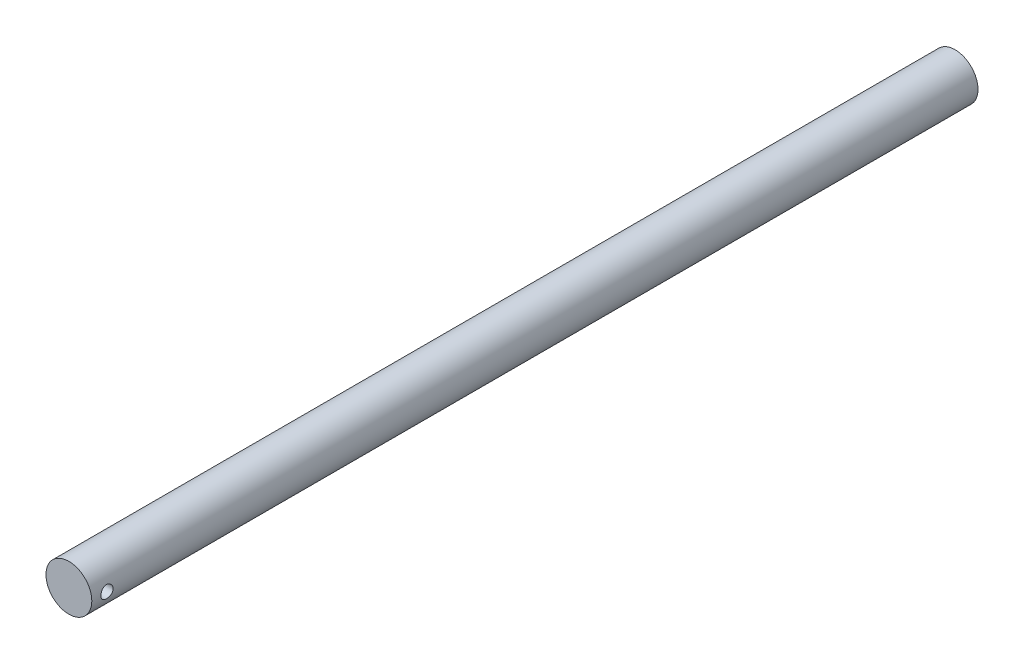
from build123d import *

# Parameters (mm, degrees)
ESQUISSE1_R             = 0.75
BASE_EXTRUSION_DEPTH    = 29
ESQUISSE5_R             = 0.2
ENL_V_MAT_EXTRU_2_DEPTH = 1


with BuildPart() as part:
    # Esquisse1 → Base-Extrusion (new body)
    with BuildSketch(Plane.XY):
        Circle(ESQUISSE1_R)
    extrude(amount=BASE_EXTRUSION_DEPTH)

    # Esquisse5 → Enl_v. mat.-Extru.2 (cut, symmetric)
    with BuildSketch(Plane(origin=(0, 0, 0), x_dir=(0, 0, -1), z_dir=(1, 0, 0))):
        with Locations(Location((-28.5, 0, 0), (0, 0, 180))):
            Circle(ESQUISSE5_R)
    extrude(amount=ENL_V_MAT_EXTRU_2_DEPTH, both=True, mode=Mode.SUBTRACT)


solid = part.part
